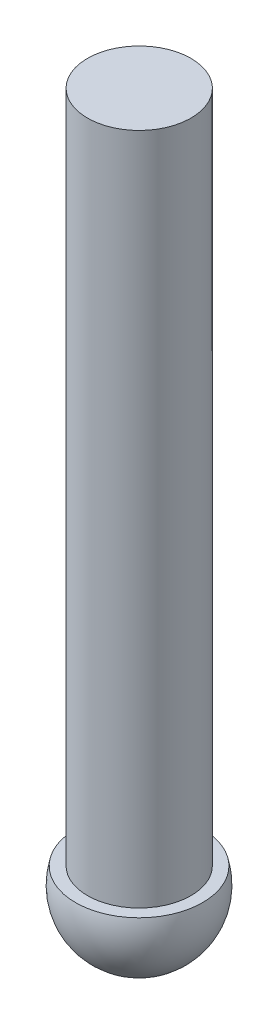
from build123d import *

# Parameters (mm, degrees)
SKETCH1_R      = 15
EXTRUDE1_DEPTH = 199.999999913


with BuildPart() as part:
    # Sketch1 → Extrude1 (new body)
    with BuildSketch(Plane(origin=(-2935.015919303, 0, 0), x_dir=(-1, 0, 0), z_dir=(0, 1, 0))):
        with Locations(Location((-2935.015919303, -0.05, 0), (0, 0, 90))):
            Circle(SKETCH1_R)
    extrude(amount=-EXTRUDE1_DEPTH)

    # Sketch2 → Revolve1 (revolve)
    with BuildSketch(Plane.XY, mode=Mode.PRIVATE) as revolve1_sk:
        with BuildLine():
            Line((0, -195.176539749), (0, -219.049999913))
            ThreePointArc((0, -219.049999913), (15.079612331, -211.640781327), (18.429235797, -195.176539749))
            Line((18.429235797, -195.176539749), (0, -195.176539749))
        make_face()
    revolve(revolve1_sk.sketch.rotate(Axis((0, -234.311066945, 0), (0, 1, 0)), 180), axis=Axis((0, -234.311066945, 0), (0, 1, 0)))


solid = part.part
